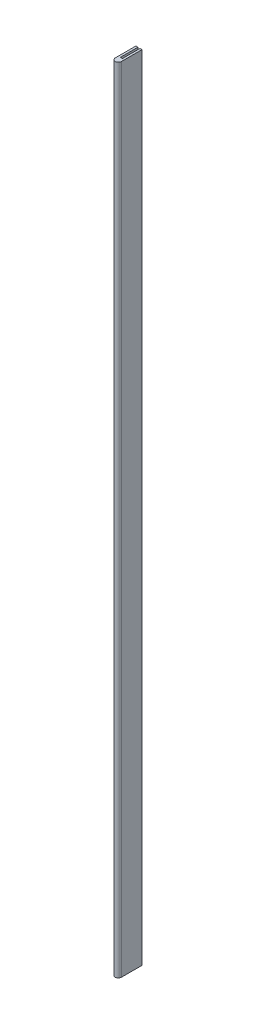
ISO-10303-21;
HEADER;
FILE_DESCRIPTION(('STEP AP214'),'2;1');
FILE_NAME('part.step','',(''),(''),'','','');
FILE_SCHEMA(('AUTOMOTIVE_DESIGN { 1 0 10303 214 1 1 1 1 }'));
ENDSEC;
DATA;
#1=APPLICATION_CONTEXT('core data for automotive mechanical design processes');
#2=APPLICATION_PROTOCOL_DEFINITION('international standard','automotive_design',2000,#1);
#3=PRODUCT_CONTEXT('',#1,'mechanical');
#4=PRODUCT('Part','Part','',(#3));
#5=PRODUCT_RELATED_PRODUCT_CATEGORY('part','',(#4));
#6=PRODUCT_DEFINITION_FORMATION('','',#4);
#7=PRODUCT_DEFINITION_CONTEXT('part definition',#1,'design');
#8=PRODUCT_DEFINITION('design','',#6,#7);
#9=PRODUCT_DEFINITION_SHAPE('','',#8);
#10=(LENGTH_UNIT() NAMED_UNIT(*) SI_UNIT(.MILLI.,.METRE.));
#11=(NAMED_UNIT(*) PLANE_ANGLE_UNIT() SI_UNIT($,.RADIAN.));
#12=(NAMED_UNIT(*) SI_UNIT($,.STERADIAN.) SOLID_ANGLE_UNIT());
#13=UNCERTAINTY_MEASURE_WITH_UNIT(LENGTH_MEASURE(1.E-05),#10,'distance_accuracy_value','');
#14=(GEOMETRIC_REPRESENTATION_CONTEXT(3) GLOBAL_UNCERTAINTY_ASSIGNED_CONTEXT((#13)) GLOBAL_UNIT_ASSIGNED_CONTEXT((#10,
#11,#12)) REPRESENTATION_CONTEXT('',''));
#15=CARTESIAN_POINT('',(0.,0.,0.));
#16=DIRECTION('',(0.,0.,1.));
#17=DIRECTION('',(1.,0.,0.));
#18=AXIS2_PLACEMENT_3D('',#15,#16,#17);
#19=CARTESIAN_POINT('',(0.,609.6,0.));
#20=DIRECTION('',(0.,-1.,0.));
#21=DIRECTION('',(0.,0.,-1.));
#22=AXIS2_PLACEMENT_3D('',#19,#20,#21);
#23=CYLINDRICAL_SURFACE('',#22,2.38125);
#24=CARTESIAN_POINT('',(0.,0.,0.));
#25=DIRECTION('',(0.,1.,0.));
#26=DIRECTION('',(0.,0.,1.));
#27=AXIS2_PLACEMENT_3D('',#24,#25,#26);
#28=CIRCLE('',#27,2.38125);
#29=CARTESIAN_POINT('',(0.793750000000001,0.,-2.24506403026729));
#30=VERTEX_POINT('',#29);
#31=CARTESIAN_POINT('',(-0.793750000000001,0.,-2.24506403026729));
#32=VERTEX_POINT('',#31);
#33=EDGE_CURVE('E129',#30,#32,#28,.T.);
#34=ORIENTED_EDGE('',*,*,#33,.T.);
#35=DIRECTION('',(0.,-1.,0.));
#36=VECTOR('',#35,1.);
#37=CARTESIAN_POINT('',(-0.793750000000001,609.6,-2.24506403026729));
#38=LINE('',#37,#36);
#39=CARTESIAN_POINT('',(-0.793750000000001,609.6,-2.24506403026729));
#40=VERTEX_POINT('',#39);
#41=EDGE_CURVE('E130',#32,#40,#38,.F.);
#42=ORIENTED_EDGE('',*,*,#41,.T.);
#43=CARTESIAN_POINT('',(0.,609.6,0.));
#44=DIRECTION('',(0.,1.,0.));
#45=DIRECTION('',(0.,0.,1.));
#46=AXIS2_PLACEMENT_3D('',#43,#44,#45);
#47=CIRCLE('',#46,2.38125);
#48=CARTESIAN_POINT('',(0.793750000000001,609.6,-2.24506403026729));
#49=VERTEX_POINT('',#48);
#50=EDGE_CURVE('E11',#49,#40,#47,.T.);
#51=ORIENTED_EDGE('',*,*,#50,.F.);
#52=DIRECTION('',(0.,-1.,0.));
#53=VECTOR('',#52,1.);
#54=CARTESIAN_POINT('',(0.79375,609.6,-2.24506403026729));
#55=LINE('',#54,#53);
#56=EDGE_CURVE('E133',#49,#30,#55,.T.);
#57=ORIENTED_EDGE('',*,*,#56,.T.);
#58=EDGE_LOOP('',(#34,#42,#51,#57));
#59=FACE_BOUND('',#58,.T.);
#60=ADVANCED_FACE('F38',(#59),#23,.T.);
#61=CARTESIAN_POINT('',(-2.38125,609.6,0.));
#62=VERTEX_POINT('',#61);
#63=CARTESIAN_POINT('',(2.38125,609.6,0.));
#64=VERTEX_POINT('',#63);
#65=EDGE_CURVE('E47',#62,#64,#47,.T.);
#66=ORIENTED_EDGE('',*,*,#65,.F.);
#67=DIRECTION('',(0.,1.,0.));
#68=VECTOR('',#67,1.);
#69=CARTESIAN_POINT('',(-2.38125,0.,0.));
#70=LINE('',#69,#68);
#71=CARTESIAN_POINT('',(-2.38125,0.,0.));
#72=VERTEX_POINT('',#71);
#73=EDGE_CURVE('E108',#72,#62,#70,.T.);
#74=ORIENTED_EDGE('',*,*,#73,.F.);
#75=CARTESIAN_POINT('',(2.38125,0.,0.));
#76=VERTEX_POINT('',#75);
#77=EDGE_CURVE('E42',#72,#76,#28,.T.);
#78=ORIENTED_EDGE('',*,*,#77,.T.);
#79=DIRECTION('',(0.,1.,0.));
#80=VECTOR('',#79,1.);
#81=CARTESIAN_POINT('',(2.38125,0.,0.));
#82=LINE('',#81,#80);
#83=EDGE_CURVE('E160',#76,#64,#82,.T.);
#84=ORIENTED_EDGE('',*,*,#83,.T.);
#85=EDGE_LOOP('',(#66,#74,#78,#84));
#86=FACE_BOUND('',#85,.T.);
#87=ADVANCED_FACE('F40',(#86),#23,.T.);
#88=CARTESIAN_POINT('',(0.,609.6,0.));
#89=DIRECTION('',(0.,1.,0.));
#90=DIRECTION('',(0.,0.,1.));
#91=AXIS2_PLACEMENT_3D('',#88,#89,#90);
#92=PLANE('',#91);
#93=ORIENTED_EDGE('',*,*,#50,.T.);
#94=DIRECTION('',(0.,0.,-1.));
#95=VECTOR('',#94,1.);
#96=CARTESIAN_POINT('',(-0.793750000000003,609.6,-15.875));
#97=LINE('',#96,#95);
#98=CARTESIAN_POINT('',(-0.793750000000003,609.6,-15.875));
#99=VERTEX_POINT('',#98);
#100=EDGE_CURVE('E167',#40,#99,#97,.T.);
#101=ORIENTED_EDGE('',*,*,#100,.T.);
#102=DIRECTION('',(-1.,0.,0.));
#103=VECTOR('',#102,1.);
#104=CARTESIAN_POINT('',(-2.38125,609.6,-15.875));
#105=LINE('',#104,#103);
#106=CARTESIAN_POINT('',(-2.38125,609.6,-15.875));
#107=VERTEX_POINT('',#106);
#108=EDGE_CURVE('E116',#99,#107,#105,.T.);
#109=ORIENTED_EDGE('',*,*,#108,.T.);
#110=DIRECTION('',(0.,0.,1.));
#111=VECTOR('',#110,1.);
#112=CARTESIAN_POINT('',(-2.38125,609.6,-15.875));
#113=LINE('',#112,#111);
#114=EDGE_CURVE('E54',#107,#62,#113,.T.);
#115=ORIENTED_EDGE('',*,*,#114,.T.);
#116=ORIENTED_EDGE('',*,*,#65,.T.);
#117=DIRECTION('',(0.,0.,-1.));
#118=VECTOR('',#117,1.);
#119=CARTESIAN_POINT('',(2.38125,609.6,-15.875));
#120=LINE('',#119,#118);
#121=CARTESIAN_POINT('',(2.38125,609.6,-15.875));
#122=VERTEX_POINT('',#121);
#123=EDGE_CURVE('E142',#64,#122,#120,.T.);
#124=ORIENTED_EDGE('',*,*,#123,.T.);
#125=DIRECTION('',(-1.,0.,0.));
#126=VECTOR('',#125,1.);
#127=CARTESIAN_POINT('',(0.793749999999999,609.6,-15.875));
#128=LINE('',#127,#126);
#129=CARTESIAN_POINT('',(0.793749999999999,609.6,-15.875));
#130=VERTEX_POINT('',#129);
#131=EDGE_CURVE('E144',#122,#130,#128,.T.);
#132=ORIENTED_EDGE('',*,*,#131,.T.);
#133=DIRECTION('',(0.,0.,1.));
#134=VECTOR('',#133,1.);
#135=CARTESIAN_POINT('',(0.793749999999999,609.6,-15.875));
#136=LINE('',#135,#134);
#137=EDGE_CURVE('E60',#130,#49,#136,.T.);
#138=ORIENTED_EDGE('',*,*,#137,.T.);
#139=EDGE_LOOP('',(#93,#101,#109,#115,#116,#124,#132,#138));
#140=FACE_BOUND('',#139,.T.);
#141=ADVANCED_FACE('F141',(#140),#92,.T.);
#142=CARTESIAN_POINT('',(0.,0.,0.));
#143=DIRECTION('',(0.,1.,0.));
#144=DIRECTION('',(0.,0.,1.));
#145=AXIS2_PLACEMENT_3D('',#142,#143,#144);
#146=PLANE('',#145);
#147=ORIENTED_EDGE('',*,*,#77,.F.);
#148=DIRECTION('',(0.,0.,1.));
#149=VECTOR('',#148,1.);
#150=CARTESIAN_POINT('',(-2.38125,0.,-15.875));
#151=LINE('',#150,#149);
#152=CARTESIAN_POINT('',(-2.38125,0.,-15.875));
#153=VERTEX_POINT('',#152);
#154=EDGE_CURVE('E105',#153,#72,#151,.T.);
#155=ORIENTED_EDGE('',*,*,#154,.F.);
#156=DIRECTION('',(-1.,0.,0.));
#157=VECTOR('',#156,1.);
#158=CARTESIAN_POINT('',(-2.38125,0.,-15.875));
#159=LINE('',#158,#157);
#160=CARTESIAN_POINT('',(-0.793750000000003,0.,-15.875));
#161=VERTEX_POINT('',#160);
#162=EDGE_CURVE('E122',#161,#153,#159,.T.);
#163=ORIENTED_EDGE('',*,*,#162,.F.);
#164=DIRECTION('',(0.,0.,-1.));
#165=VECTOR('',#164,1.);
#166=CARTESIAN_POINT('',(-0.793750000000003,0.,-15.875));
#167=LINE('',#166,#165);
#168=EDGE_CURVE('E115',#32,#161,#167,.T.);
#169=ORIENTED_EDGE('',*,*,#168,.F.);
#170=ORIENTED_EDGE('',*,*,#33,.F.);
#171=DIRECTION('',(0.,0.,1.));
#172=VECTOR('',#171,1.);
#173=CARTESIAN_POINT('',(0.793749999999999,0.,-15.875));
#174=LINE('',#173,#172);
#175=CARTESIAN_POINT('',(0.793749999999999,0.,-15.875));
#176=VERTEX_POINT('',#175);
#177=EDGE_CURVE('E152',#176,#30,#174,.T.);
#178=ORIENTED_EDGE('',*,*,#177,.F.);
#179=DIRECTION('',(-1.,0.,0.));
#180=VECTOR('',#179,1.);
#181=CARTESIAN_POINT('',(0.793749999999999,0.,-15.875));
#182=LINE('',#181,#180);
#183=CARTESIAN_POINT('',(2.38125,0.,-15.875));
#184=VERTEX_POINT('',#183);
#185=EDGE_CURVE('E158',#184,#176,#182,.T.);
#186=ORIENTED_EDGE('',*,*,#185,.F.);
#187=DIRECTION('',(0.,0.,-1.));
#188=VECTOR('',#187,1.);
#189=CARTESIAN_POINT('',(2.38125,0.,-15.875));
#190=LINE('',#189,#188);
#191=EDGE_CURVE('E128',#76,#184,#190,.T.);
#192=ORIENTED_EDGE('',*,*,#191,.F.);
#193=EDGE_LOOP('',(#147,#155,#163,#169,#170,#178,#186,#192));
#194=FACE_BOUND('',#193,.T.);
#195=ADVANCED_FACE('F125',(#194),#146,.F.);
#196=CARTESIAN_POINT('',(0.793749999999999,0.,-15.875));
#197=DIRECTION('',(-1.,0.,0.));
#198=DIRECTION('',(0.,0.,1.));
#199=AXIS2_PLACEMENT_3D('',#196,#197,#198);
#200=PLANE('',#199);
#201=ORIENTED_EDGE('',*,*,#56,.F.);
#202=ORIENTED_EDGE('',*,*,#137,.F.);
#203=DIRECTION('',(0.,1.,0.));
#204=VECTOR('',#203,1.);
#205=CARTESIAN_POINT('',(0.793749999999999,0.,-15.875));
#206=LINE('',#205,#204);
#207=EDGE_CURVE('E151',#176,#130,#206,.T.);
#208=ORIENTED_EDGE('',*,*,#207,.F.);
#209=ORIENTED_EDGE('',*,*,#177,.T.);
#210=EDGE_LOOP('',(#201,#202,#208,#209));
#211=FACE_BOUND('',#210,.T.);
#212=ADVANCED_FACE('F166',(#211),#200,.T.);
#213=CARTESIAN_POINT('',(0.793749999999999,0.,-15.875));
#214=DIRECTION('',(0.,0.,-1.));
#215=DIRECTION('',(-1.,0.,0.));
#216=AXIS2_PLACEMENT_3D('',#213,#214,#215);
#217=PLANE('',#216);
#218=ORIENTED_EDGE('',*,*,#131,.F.);
#219=DIRECTION('',(0.,1.,0.));
#220=VECTOR('',#219,1.);
#221=CARTESIAN_POINT('',(2.38125,0.,-15.875));
#222=LINE('',#221,#220);
#223=EDGE_CURVE('E150',#184,#122,#222,.T.);
#224=ORIENTED_EDGE('',*,*,#223,.F.);
#225=ORIENTED_EDGE('',*,*,#185,.T.);
#226=ORIENTED_EDGE('',*,*,#207,.T.);
#227=EDGE_LOOP('',(#218,#224,#225,#226));
#228=FACE_BOUND('',#227,.T.);
#229=ADVANCED_FACE('F148',(#228),#217,.T.);
#230=CARTESIAN_POINT('',(2.38125,0.,-15.875));
#231=DIRECTION('',(1.,0.,0.));
#232=DIRECTION('',(0.,0.,-1.));
#233=AXIS2_PLACEMENT_3D('',#230,#231,#232);
#234=PLANE('',#233);
#235=ORIENTED_EDGE('',*,*,#123,.F.);
#236=ORIENTED_EDGE('',*,*,#83,.F.);
#237=ORIENTED_EDGE('',*,*,#191,.T.);
#238=ORIENTED_EDGE('',*,*,#223,.T.);
#239=EDGE_LOOP('',(#235,#236,#237,#238));
#240=FACE_BOUND('',#239,.T.);
#241=ADVANCED_FACE('F161',(#240),#234,.T.);
#242=CARTESIAN_POINT('',(-0.793750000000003,0.,-15.875));
#243=DIRECTION('',(1.,0.,0.));
#244=DIRECTION('',(0.,0.,-1.));
#245=AXIS2_PLACEMENT_3D('',#242,#243,#244);
#246=PLANE('',#245);
#247=ORIENTED_EDGE('',*,*,#41,.F.);
#248=ORIENTED_EDGE('',*,*,#168,.T.);
#249=DIRECTION('',(0.,1.,0.));
#250=VECTOR('',#249,1.);
#251=CARTESIAN_POINT('',(-0.793750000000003,0.,-15.875));
#252=LINE('',#251,#250);
#253=EDGE_CURVE('E121',#161,#99,#252,.T.);
#254=ORIENTED_EDGE('',*,*,#253,.T.);
#255=ORIENTED_EDGE('',*,*,#100,.F.);
#256=EDGE_LOOP('',(#247,#248,#254,#255));
#257=FACE_BOUND('',#256,.T.);
#258=ADVANCED_FACE('F173',(#257),#246,.T.);
#259=CARTESIAN_POINT('',(-2.38125,0.,-15.875));
#260=DIRECTION('',(-1.,0.,0.));
#261=DIRECTION('',(0.,0.,1.));
#262=AXIS2_PLACEMENT_3D('',#259,#260,#261);
#263=PLANE('',#262);
#264=ORIENTED_EDGE('',*,*,#114,.F.);
#265=DIRECTION('',(0.,1.,0.));
#266=VECTOR('',#265,1.);
#267=CARTESIAN_POINT('',(-2.38125,0.,-15.875));
#268=LINE('',#267,#266);
#269=EDGE_CURVE('E110',#153,#107,#268,.T.);
#270=ORIENTED_EDGE('',*,*,#269,.F.);
#271=ORIENTED_EDGE('',*,*,#154,.T.);
#272=ORIENTED_EDGE('',*,*,#73,.T.);
#273=EDGE_LOOP('',(#264,#270,#271,#272));
#274=FACE_BOUND('',#273,.T.);
#275=ADVANCED_FACE('F107',(#274),#263,.T.);
#276=CARTESIAN_POINT('',(-2.38125,0.,-15.875));
#277=DIRECTION('',(0.,0.,-1.));
#278=DIRECTION('',(-1.,0.,0.));
#279=AXIS2_PLACEMENT_3D('',#276,#277,#278);
#280=PLANE('',#279);
#281=ORIENTED_EDGE('',*,*,#108,.F.);
#282=ORIENTED_EDGE('',*,*,#253,.F.);
#283=ORIENTED_EDGE('',*,*,#162,.T.);
#284=ORIENTED_EDGE('',*,*,#269,.T.);
#285=EDGE_LOOP('',(#281,#282,#283,#284));
#286=FACE_BOUND('',#285,.T.);
#287=ADVANCED_FACE('F176',(#286),#280,.T.);
#288=CLOSED_SHELL('',(#60,#87,#141,#195,#212,#229,#241,#258,#275,#287));
#289=MANIFOLD_SOLID_BREP('B2',#288);
#290=ADVANCED_BREP_SHAPE_REPRESENTATION('',(#18,#289),#14);
#291=SHAPE_DEFINITION_REPRESENTATION(#9,#290);
ENDSEC;
END-ISO-10303-21;
